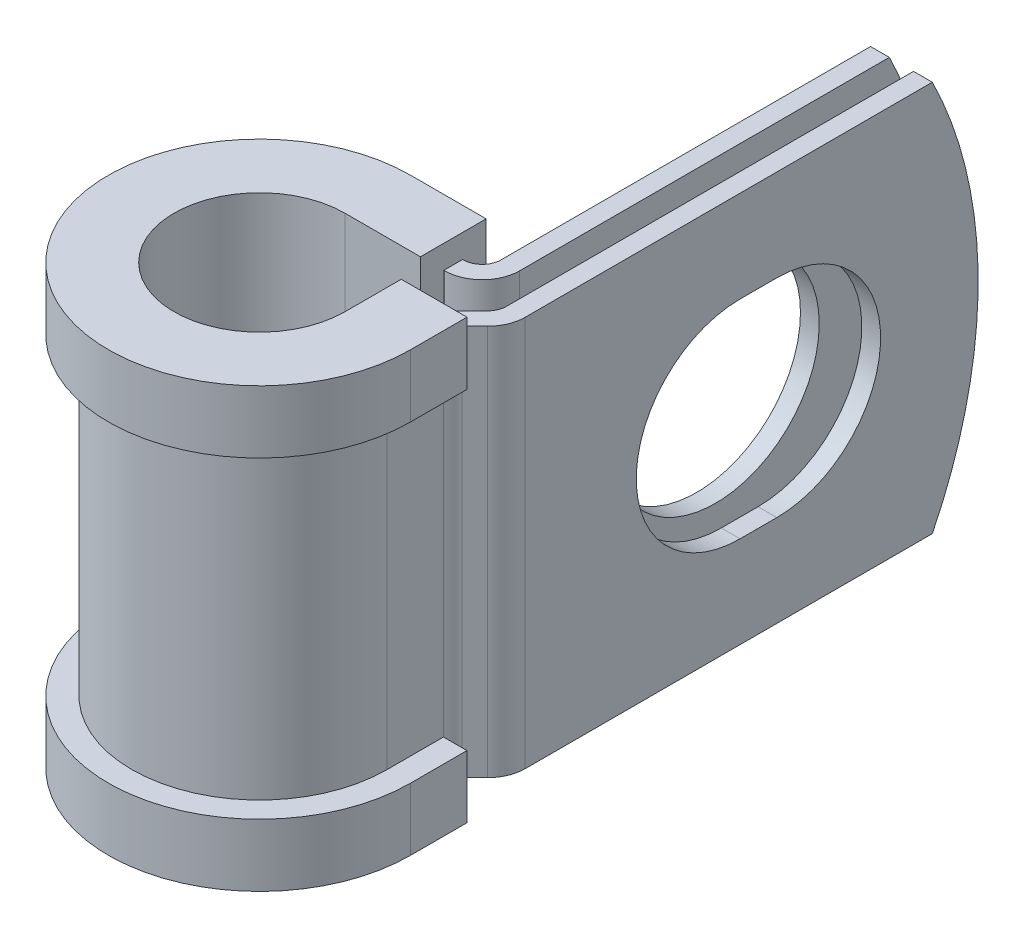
ISO-10303-21;
HEADER;
FILE_DESCRIPTION(('STEP AP214'),'2;1');
FILE_NAME('part.step','',(''),(''),'','','');
FILE_SCHEMA(('AUTOMOTIVE_DESIGN { 1 0 10303 214 1 1 1 1 }'));
ENDSEC;
DATA;
#1=APPLICATION_CONTEXT('core data for automotive mechanical design processes');
#2=APPLICATION_PROTOCOL_DEFINITION('international standard','automotive_design',2000,#1);
#3=PRODUCT_CONTEXT('',#1,'mechanical');
#4=PRODUCT('Part','Part','',(#3));
#5=PRODUCT_RELATED_PRODUCT_CATEGORY('part','',(#4));
#6=PRODUCT_DEFINITION_FORMATION('','',#4);
#7=PRODUCT_DEFINITION_CONTEXT('part definition',#1,'design');
#8=PRODUCT_DEFINITION('design','',#6,#7);
#9=PRODUCT_DEFINITION_SHAPE('','',#8);
#10=(LENGTH_UNIT() NAMED_UNIT(*) SI_UNIT(.MILLI.,.METRE.));
#11=(NAMED_UNIT(*) PLANE_ANGLE_UNIT() SI_UNIT($,.RADIAN.));
#12=(NAMED_UNIT(*) SI_UNIT($,.STERADIAN.) SOLID_ANGLE_UNIT());
#13=UNCERTAINTY_MEASURE_WITH_UNIT(LENGTH_MEASURE(1.E-05),#10,'distance_accuracy_value','');
#14=(GEOMETRIC_REPRESENTATION_CONTEXT(3) GLOBAL_UNCERTAINTY_ASSIGNED_CONTEXT((#13)) GLOBAL_UNIT_ASSIGNED_CONTEXT((#10,
#11,#12)) REPRESENTATION_CONTEXT('',''));
#15=CARTESIAN_POINT('',(0.,0.,0.));
#16=DIRECTION('',(0.,0.,1.));
#17=DIRECTION('',(1.,0.,0.));
#18=AXIS2_PLACEMENT_3D('',#15,#16,#17);
#19=CARTESIAN_POINT('',(7.75216980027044,-12.7,-7.0739));
#20=DIRECTION('',(0.,1.,0.));
#21=DIRECTION('',(1.,0.,0.));
#22=AXIS2_PLACEMENT_3D('',#19,#20,#21);
#23=PLANE('',#22);
#24=DIRECTION('',(0.,0.,-1.));
#25=VECTOR('',#24,1.);
#26=CARTESIAN_POINT('',(4.90736980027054,-12.7,-7.0739));
#27=LINE('',#26,#25);
#28=CARTESIAN_POINT('',(4.90736980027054,-12.7,-7.0739));
#29=VERTEX_POINT('',#28);
#30=CARTESIAN_POINT('',(4.90736980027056,-12.7,-8.2931));
#31=VERTEX_POINT('',#30);
#32=EDGE_CURVE('E523',#29,#31,#27,.T.);
#33=ORIENTED_EDGE('',*,*,#32,.T.);
#34=DIRECTION('',(1.,0.,0.));
#35=VECTOR('',#34,1.);
#36=CARTESIAN_POINT('',(0.,-12.7,-8.2931));
#37=LINE('',#36,#35);
#38=CARTESIAN_POINT('',(4.95816980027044,-12.7,-8.2931));
#39=VERTEX_POINT('',#38);
#40=EDGE_CURVE('E410',#39,#31,#37,.F.);
#41=ORIENTED_EDGE('',*,*,#40,.F.);
#42=CARTESIAN_POINT('',(4.95816980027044,-12.7,-9.5123));
#43=DIRECTION('',(0.,1.,0.));
#44=DIRECTION('',(1.,0.,0.));
#45=AXIS2_PLACEMENT_3D('',#42,#43,#44);
#46=CIRCLE('',#45,1.2192);
#47=CARTESIAN_POINT('',(6.17736980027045,-12.7,-9.5123));
#48=VERTEX_POINT('',#47);
#49=EDGE_CURVE('E408',#48,#39,#46,.F.);
#50=ORIENTED_EDGE('',*,*,#49,.F.);
#51=DIRECTION('',(0.,0.,1.));
#52=VECTOR('',#51,1.);
#53=CARTESIAN_POINT('',(6.17736980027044,-12.7,-36.4998));
#54=LINE('',#53,#52);
#55=CARTESIAN_POINT('',(6.17736980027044,-12.7,-33.5224683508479));
#56=VERTEX_POINT('',#55);
#57=EDGE_CURVE('E406',#56,#48,#54,.T.);
#58=ORIENTED_EDGE('',*,*,#57,.F.);
#59=DIRECTION('',(-1.,0.,0.));
#60=VECTOR('',#59,1.);
#61=CARTESIAN_POINT('',(10.1905698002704,-12.7,-33.5224683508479));
#62=LINE('',#61,#60);
#63=CARTESIAN_POINT('',(7.39656980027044,-12.7,-33.5224683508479));
#64=VERTEX_POINT('',#63);
#65=EDGE_CURVE('E12',#64,#56,#62,.T.);
#66=ORIENTED_EDGE('',*,*,#65,.F.);
#67=DIRECTION('',(0.,0.,1.));
#68=VECTOR('',#67,1.);
#69=CARTESIAN_POINT('',(7.39656980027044,-12.7,-36.4998));
#70=LINE('',#69,#68);
#71=CARTESIAN_POINT('',(7.39656980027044,-12.7,-9.5123));
#72=VERTEX_POINT('',#71);
#73=EDGE_CURVE('E404',#64,#72,#70,.T.);
#74=ORIENTED_EDGE('',*,*,#73,.T.);
#75=CARTESIAN_POINT('',(4.95816980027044,-12.7,-9.5123));
#76=DIRECTION('',(0.,-1.,0.));
#77=DIRECTION('',(0.,0.,1.));
#78=AXIS2_PLACEMENT_3D('',#75,#76,#77);
#79=CIRCLE('',#78,2.4384);
#80=CARTESIAN_POINT('',(4.95816980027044,-12.7,-7.0739));
#81=VERTEX_POINT('',#80);
#82=EDGE_CURVE('E401',#72,#81,#79,.T.);
#83=ORIENTED_EDGE('',*,*,#82,.T.);
#84=DIRECTION('',(-1.,0.,0.));
#85=VECTOR('',#84,1.);
#86=CARTESIAN_POINT('',(0.,-12.7,-7.0739));
#87=LINE('',#86,#85);
#88=EDGE_CURVE('E398',#81,#29,#87,.T.);
#89=ORIENTED_EDGE('',*,*,#88,.T.);
#90=EDGE_LOOP('',(#33,#41,#50,#58,#66,#74,#83,#89));
#91=FACE_BOUND('',#90,.T.);
#92=ADVANCED_FACE('F54',(#91),#23,.F.);
#93=CARTESIAN_POINT('',(7.75216980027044,12.7,-7.0739));
#94=DIRECTION('',(0.,1.,0.));
#95=DIRECTION('',(1.,0.,0.));
#96=AXIS2_PLACEMENT_3D('',#93,#94,#95);
#97=PLANE('',#96);
#98=DIRECTION('',(1.,0.,0.));
#99=VECTOR('',#98,1.);
#100=CARTESIAN_POINT('',(0.,12.7,-8.2931));
#101=LINE('',#100,#99);
#102=CARTESIAN_POINT('',(4.95816980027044,12.7,-8.2931));
#103=VERTEX_POINT('',#102);
#104=CARTESIAN_POINT('',(4.90736980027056,12.7,-8.2931));
#105=VERTEX_POINT('',#104);
#106=EDGE_CURVE('E368',#103,#105,#101,.F.);
#107=ORIENTED_EDGE('',*,*,#106,.T.);
#108=DIRECTION('',(0.,0.,1.));
#109=VECTOR('',#108,1.);
#110=CARTESIAN_POINT('',(4.90736980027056,12.7,-8.2931));
#111=LINE('',#110,#109);
#112=CARTESIAN_POINT('',(4.90736980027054,12.7,-7.0739));
#113=VERTEX_POINT('',#112);
#114=EDGE_CURVE('E517',#105,#113,#111,.T.);
#115=ORIENTED_EDGE('',*,*,#114,.T.);
#116=DIRECTION('',(-1.,0.,0.));
#117=VECTOR('',#116,1.);
#118=CARTESIAN_POINT('',(0.,12.7,-7.0739));
#119=LINE('',#118,#117);
#120=CARTESIAN_POINT('',(4.95816980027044,12.7,-7.0739));
#121=VERTEX_POINT('',#120);
#122=EDGE_CURVE('E625',#121,#113,#119,.T.);
#123=ORIENTED_EDGE('',*,*,#122,.F.);
#124=CARTESIAN_POINT('',(4.95816980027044,12.7,-9.5123));
#125=DIRECTION('',(0.,-1.,0.));
#126=DIRECTION('',(0.,0.,1.));
#127=AXIS2_PLACEMENT_3D('',#124,#125,#126);
#128=CIRCLE('',#127,2.4384);
#129=CARTESIAN_POINT('',(7.39656980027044,12.7,-9.5123));
#130=VERTEX_POINT('',#129);
#131=EDGE_CURVE('E370',#130,#121,#128,.T.);
#132=ORIENTED_EDGE('',*,*,#131,.F.);
#133=DIRECTION('',(0.,0.,1.));
#134=VECTOR('',#133,1.);
#135=CARTESIAN_POINT('',(7.39656980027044,12.7,-36.4998));
#136=LINE('',#135,#134);
#137=CARTESIAN_POINT('',(7.39656980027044,12.7,-33.5224683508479));
#138=VERTEX_POINT('',#137);
#139=EDGE_CURVE('E361',#138,#130,#136,.T.);
#140=ORIENTED_EDGE('',*,*,#139,.F.);
#141=DIRECTION('',(-1.,0.,0.));
#142=VECTOR('',#141,1.);
#143=CARTESIAN_POINT('',(10.1905698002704,12.7,-33.5224683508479));
#144=LINE('',#143,#142);
#145=CARTESIAN_POINT('',(6.17736980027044,12.7,-33.5224683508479));
#146=VERTEX_POINT('',#145);
#147=EDGE_CURVE('E62',#138,#146,#144,.T.);
#148=ORIENTED_EDGE('',*,*,#147,.T.);
#149=DIRECTION('',(0.,0.,1.));
#150=VECTOR('',#149,1.);
#151=CARTESIAN_POINT('',(6.17736980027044,12.7,-36.4998));
#152=LINE('',#151,#150);
#153=CARTESIAN_POINT('',(6.17736980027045,12.7,-9.5123));
#154=VERTEX_POINT('',#153);
#155=EDGE_CURVE('E358',#146,#154,#152,.T.);
#156=ORIENTED_EDGE('',*,*,#155,.T.);
#157=CARTESIAN_POINT('',(4.95816980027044,12.7,-9.5123));
#158=DIRECTION('',(0.,1.,0.));
#159=DIRECTION('',(1.,0.,0.));
#160=AXIS2_PLACEMENT_3D('',#157,#158,#159);
#161=CIRCLE('',#160,1.2192);
#162=EDGE_CURVE('E366',#154,#103,#161,.F.);
#163=ORIENTED_EDGE('',*,*,#162,.T.);
#164=EDGE_LOOP('',(#107,#115,#123,#132,#140,#148,#156,#163));
#165=FACE_BOUND('',#164,.T.);
#166=ADVANCED_FACE('F357',(#165),#97,.T.);
#167=CARTESIAN_POINT('',(0.,12.7,-7.0739));
#168=DIRECTION('',(0.,0.,1.));
#169=DIRECTION('',(1.,0.,0.));
#170=AXIS2_PLACEMENT_3D('',#167,#168,#169);
#171=PLANE('',#170);
#172=ORIENTED_EDGE('',*,*,#122,.T.);
#173=DIRECTION('',(0.,-1.,0.));
#174=VECTOR('',#173,1.);
#175=CARTESIAN_POINT('',(4.90736980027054,12.7,-7.0739));
#176=LINE('',#175,#174);
#177=EDGE_CURVE('E520',#113,#29,#176,.T.);
#178=ORIENTED_EDGE('',*,*,#177,.T.);
#179=ORIENTED_EDGE('',*,*,#88,.F.);
#180=DIRECTION('',(0.,-1.,0.));
#181=VECTOR('',#180,1.);
#182=CARTESIAN_POINT('',(4.95816980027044,12.7,-7.0739));
#183=LINE('',#182,#181);
#184=EDGE_CURVE('E344',#121,#81,#183,.T.);
#185=ORIENTED_EDGE('',*,*,#184,.F.);
#186=EDGE_LOOP('',(#172,#178,#179,#185));
#187=FACE_BOUND('',#186,.T.);
#188=ADVANCED_FACE('F635',(#187),#171,.T.);
#189=CARTESIAN_POINT('',(10.1905698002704,12.7,-7.0739));
#190=DIRECTION('',(-1.,0.,0.));
#191=DIRECTION('',(0.,0.,1.));
#192=AXIS2_PLACEMENT_3D('',#189,#190,#191);
#193=PLANE('',#192);
#194=CARTESIAN_POINT('',(10.1905698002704,0.,-23.4187999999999));
#195=DIRECTION('',(1.,0.,0.));
#196=DIRECTION('',(0.,0.,-1.));
#197=AXIS2_PLACEMENT_3D('',#194,#195,#196);
#198=CIRCLE('',#197,6.7437);
#199=CARTESIAN_POINT('',(10.1905698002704,-6.7437,-23.4188000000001));
#200=VERTEX_POINT('',#199);
#201=CARTESIAN_POINT('',(10.1905698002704,6.7437,-23.4188000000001));
#202=VERTEX_POINT('',#201);
#203=EDGE_CURVE('E580',#200,#202,#198,.T.);
#204=ORIENTED_EDGE('',*,*,#203,.F.);
#205=DIRECTION('',(0.,0.,-1.));
#206=VECTOR('',#205,1.);
#207=CARTESIAN_POINT('',(10.1905698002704,-6.7437,-21.0311999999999));
#208=LINE('',#207,#206);
#209=CARTESIAN_POINT('',(10.1905698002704,-6.7437,-21.0311999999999));
#210=VERTEX_POINT('',#209);
#211=EDGE_CURVE('E583',#210,#200,#208,.T.);
#212=ORIENTED_EDGE('',*,*,#211,.F.);
#213=CARTESIAN_POINT('',(10.1905698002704,0.,-21.0311999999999));
#214=DIRECTION('',(1.,0.,0.));
#215=DIRECTION('',(0.,0.,-1.));
#216=AXIS2_PLACEMENT_3D('',#213,#214,#215);
#217=CIRCLE('',#216,6.7437);
#218=CARTESIAN_POINT('',(10.1905698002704,6.7437,-21.0311999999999));
#219=VERTEX_POINT('',#218);
#220=EDGE_CURVE('E576',#219,#210,#217,.T.);
#221=ORIENTED_EDGE('',*,*,#220,.F.);
#222=DIRECTION('',(0.,0.,1.));
#223=VECTOR('',#222,1.);
#224=CARTESIAN_POINT('',(10.1905698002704,6.7437,-21.0311999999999));
#225=LINE('',#224,#223);
#226=EDGE_CURVE('E577',#202,#219,#225,.T.);
#227=ORIENTED_EDGE('',*,*,#226,.F.);
#228=EDGE_LOOP('',(#204,#212,#221,#227));
#229=FACE_BOUND('',#228,.T.);
#230=DIRECTION('',(0.,0.,-1.));
#231=VECTOR('',#230,1.);
#232=CARTESIAN_POINT('',(10.1905698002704,-12.7,-7.0739));
#233=LINE('',#232,#231);
#234=CARTESIAN_POINT('',(10.1905698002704,-12.7,-7.0739));
#235=VERTEX_POINT('',#234);
#236=CARTESIAN_POINT('',(10.1905698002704,-12.7,-33.5224683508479));
#237=VERTEX_POINT('',#236);
#238=EDGE_CURVE('E382',#235,#237,#233,.T.);
#239=ORIENTED_EDGE('',*,*,#238,.T.);
#240=CARTESIAN_POINT('',(10.1905698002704,0.,-7.9248));
#241=DIRECTION('',(-1.,0.,0.));
#242=DIRECTION('',(0.,0.,1.));
#243=AXIS2_PLACEMENT_3D('',#240,#241,#242);
#244=CIRCLE('',#243,28.575);
#245=CARTESIAN_POINT('',(10.1905698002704,12.7,-33.5224683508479));
#246=VERTEX_POINT('',#245);
#247=EDGE_CURVE('E568',#246,#237,#244,.T.);
#248=ORIENTED_EDGE('',*,*,#247,.F.);
#249=DIRECTION('',(0.,0.,-1.));
#250=VECTOR('',#249,1.);
#251=CARTESIAN_POINT('',(10.1905698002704,12.7,-7.0739));
#252=LINE('',#251,#250);
#253=CARTESIAN_POINT('',(10.1905698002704,12.7,-7.0739));
#254=VERTEX_POINT('',#253);
#255=EDGE_CURVE('E419',#254,#246,#252,.T.);
#256=ORIENTED_EDGE('',*,*,#255,.F.);
#257=DIRECTION('',(0.,-1.,0.));
#258=VECTOR('',#257,1.);
#259=CARTESIAN_POINT('',(10.1905698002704,12.7,-7.0739));
#260=LINE('',#259,#258);
#261=EDGE_CURVE('E381',#254,#235,#260,.T.);
#262=ORIENTED_EDGE('',*,*,#261,.T.);
#263=EDGE_LOOP('',(#239,#248,#256,#262));
#264=FACE_BOUND('',#263,.T.);
#265=ADVANCED_FACE('F56',(#229,#264),#193,.F.);
#266=CARTESIAN_POINT('',(8.97136980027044,12.7,-7.0739));
#267=DIRECTION('',(-1.,0.,0.));
#268=DIRECTION('',(0.,0.,1.));
#269=AXIS2_PLACEMENT_3D('',#266,#267,#268);
#270=PLANE('',#269);
#271=DIRECTION('',(0.,0.,-1.));
#272=VECTOR('',#271,1.);
#273=CARTESIAN_POINT('',(8.97136980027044,-6.7437,-21.0311999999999));
#274=LINE('',#273,#272);
#275=CARTESIAN_POINT('',(8.97136980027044,-6.7437,-21.0311999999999));
#276=VERTEX_POINT('',#275);
#277=CARTESIAN_POINT('',(8.97136980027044,-6.7437,-23.4188000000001));
#278=VERTEX_POINT('',#277);
#279=EDGE_CURVE('E579',#276,#278,#274,.T.);
#280=ORIENTED_EDGE('',*,*,#279,.T.);
#281=CARTESIAN_POINT('',(8.97136980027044,0.,-23.4187999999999));
#282=DIRECTION('',(-1.,0.,0.));
#283=DIRECTION('',(0.,0.,1.));
#284=AXIS2_PLACEMENT_3D('',#281,#282,#283);
#285=CIRCLE('',#284,6.7437);
#286=CARTESIAN_POINT('',(8.97136980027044,6.7437,-23.4188000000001));
#287=VERTEX_POINT('',#286);
#288=EDGE_CURVE('E600',#278,#287,#285,.F.);
#289=ORIENTED_EDGE('',*,*,#288,.T.);
#290=DIRECTION('',(0.,0.,1.));
#291=VECTOR('',#290,1.);
#292=CARTESIAN_POINT('',(8.97136980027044,6.7437,-21.0311999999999));
#293=LINE('',#292,#291);
#294=CARTESIAN_POINT('',(8.97136980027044,6.7437,-21.0311999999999));
#295=VERTEX_POINT('',#294);
#296=EDGE_CURVE('E596',#287,#295,#293,.T.);
#297=ORIENTED_EDGE('',*,*,#296,.T.);
#298=CARTESIAN_POINT('',(8.97136980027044,0.,-21.0311999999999));
#299=DIRECTION('',(-1.,0.,0.));
#300=DIRECTION('',(0.,0.,1.));
#301=AXIS2_PLACEMENT_3D('',#298,#299,#300);
#302=CIRCLE('',#301,6.7437);
#303=EDGE_CURVE('E591',#295,#276,#302,.F.);
#304=ORIENTED_EDGE('',*,*,#303,.T.);
#305=EDGE_LOOP('',(#280,#289,#297,#304));
#306=FACE_BOUND('',#305,.T.);
#307=CARTESIAN_POINT('',(8.97136980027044,0.,-7.9248));
#308=DIRECTION('',(-1.,0.,0.));
#309=DIRECTION('',(0.,0.,1.));
#310=AXIS2_PLACEMENT_3D('',#307,#308,#309);
#311=CIRCLE('',#310,28.575);
#312=CARTESIAN_POINT('',(8.97136980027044,12.7,-33.5224683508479));
#313=VERTEX_POINT('',#312);
#314=CARTESIAN_POINT('',(8.97136980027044,-12.7,-33.5224683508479));
#315=VERTEX_POINT('',#314);
#316=EDGE_CURVE('E76',#313,#315,#311,.T.);
#317=ORIENTED_EDGE('',*,*,#316,.T.);
#318=DIRECTION('',(0.,0.,-1.));
#319=VECTOR('',#318,1.);
#320=CARTESIAN_POINT('',(8.97136980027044,-12.7,-7.0739));
#321=LINE('',#320,#319);
#322=CARTESIAN_POINT('',(8.97136980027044,-12.7,-7.0739));
#323=VERTEX_POINT('',#322);
#324=EDGE_CURVE('E385',#323,#315,#321,.T.);
#325=ORIENTED_EDGE('',*,*,#324,.F.);
#326=DIRECTION('',(0.,-1.,0.));
#327=VECTOR('',#326,1.);
#328=CARTESIAN_POINT('',(8.97136980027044,12.7,-7.0739));
#329=LINE('',#328,#327);
#330=CARTESIAN_POINT('',(8.97136980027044,12.7,-7.0739));
#331=VERTEX_POINT('',#330);
#332=EDGE_CURVE('E352',#331,#323,#329,.T.);
#333=ORIENTED_EDGE('',*,*,#332,.F.);
#334=DIRECTION('',(0.,0.,-1.));
#335=VECTOR('',#334,1.);
#336=CARTESIAN_POINT('',(8.97136980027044,12.7,-7.0739));
#337=LINE('',#336,#335);
#338=EDGE_CURVE('E615',#331,#313,#337,.T.);
#339=ORIENTED_EDGE('',*,*,#338,.T.);
#340=EDGE_LOOP('',(#317,#325,#333,#339));
#341=FACE_BOUND('',#340,.T.);
#342=ADVANCED_FACE('F689',(#306,#341),#270,.T.);
#343=CARTESIAN_POINT('',(7.39656980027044,12.7,-36.4998));
#344=DIRECTION('',(1.,0.,0.));
#345=DIRECTION('',(0.,0.,-1.));
#346=AXIS2_PLACEMENT_3D('',#343,#344,#345);
#347=PLANE('',#346);
#348=CARTESIAN_POINT('',(7.39656980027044,0.,-22.225));
#349=DIRECTION('',(1.,0.,0.));
#350=DIRECTION('',(0.,0.,-1.));
#351=AXIS2_PLACEMENT_3D('',#348,#349,#350);
#352=CIRCLE('',#351,6.7437);
#353=CARTESIAN_POINT('',(7.39656980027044,0.,-28.9687));
#354=VERTEX_POINT('',#353);
#355=EDGE_CURVE('E386',#354,#354,#352,.F.);
#356=ORIENTED_EDGE('',*,*,#355,.T.);
#357=EDGE_LOOP('',(#356));
#358=FACE_BOUND('',#357,.T.);
#359=ORIENTED_EDGE('',*,*,#73,.F.);
#360=CARTESIAN_POINT('',(7.39656980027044,0.,-7.9248));
#361=DIRECTION('',(1.,0.,0.));
#362=DIRECTION('',(0.,0.,-1.));
#363=AXIS2_PLACEMENT_3D('',#360,#361,#362);
#364=CIRCLE('',#363,28.575);
#365=EDGE_CURVE('E573',#64,#138,#364,.T.);
#366=ORIENTED_EDGE('',*,*,#365,.T.);
#367=ORIENTED_EDGE('',*,*,#139,.T.);
#368=DIRECTION('',(0.,-1.,0.));
#369=VECTOR('',#368,1.);
#370=CARTESIAN_POINT('',(7.39656980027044,12.7,-9.5123));
#371=LINE('',#370,#369);
#372=EDGE_CURVE('E341',#130,#72,#371,.T.);
#373=ORIENTED_EDGE('',*,*,#372,.T.);
#374=EDGE_LOOP('',(#359,#366,#367,#373));
#375=FACE_BOUND('',#374,.T.);
#376=ADVANCED_FACE('F641',(#358,#375),#347,.T.);
#377=CARTESIAN_POINT('',(6.17736980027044,12.7,-36.4998));
#378=DIRECTION('',(1.,0.,0.));
#379=DIRECTION('',(0.,0.,-1.));
#380=AXIS2_PLACEMENT_3D('',#377,#378,#379);
#381=PLANE('',#380);
#382=CARTESIAN_POINT('',(6.17736980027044,0.,-22.225));
#383=DIRECTION('',(-1.,0.,0.));
#384=DIRECTION('',(0.,0.,1.));
#385=AXIS2_PLACEMENT_3D('',#382,#383,#384);
#386=CIRCLE('',#385,6.7437);
#387=CARTESIAN_POINT('',(6.17736980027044,0.,-15.4813));
#388=VERTEX_POINT('',#387);
#389=EDGE_CURVE('E608',#388,#388,#386,.T.);
#390=ORIENTED_EDGE('',*,*,#389,.F.);
#391=EDGE_LOOP('',(#390));
#392=FACE_BOUND('',#391,.T.);
#393=CARTESIAN_POINT('',(6.17736980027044,0.,-7.9248));
#394=DIRECTION('',(-1.,0.,0.));
#395=DIRECTION('',(0.,0.,1.));
#396=AXIS2_PLACEMENT_3D('',#393,#394,#395);
#397=CIRCLE('',#396,28.575);
#398=EDGE_CURVE('E68',#146,#56,#397,.T.);
#399=ORIENTED_EDGE('',*,*,#398,.T.);
#400=ORIENTED_EDGE('',*,*,#57,.T.);
#401=DIRECTION('',(0.,-1.,0.));
#402=VECTOR('',#401,1.);
#403=CARTESIAN_POINT('',(6.17736980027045,12.7,-9.5123));
#404=LINE('',#403,#402);
#405=EDGE_CURVE('E338',#154,#48,#404,.T.);
#406=ORIENTED_EDGE('',*,*,#405,.F.);
#407=ORIENTED_EDGE('',*,*,#155,.F.);
#408=EDGE_LOOP('',(#399,#400,#406,#407));
#409=FACE_BOUND('',#408,.T.);
#410=ADVANCED_FACE('F364',(#392,#409),#381,.F.);
#411=CARTESIAN_POINT('',(9.5123,-12.7,-3.66140267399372));
#412=DIRECTION('',(0.,1.,0.));
#413=DIRECTION('',(1.,0.,0.));
#414=AXIS2_PLACEMENT_3D('',#411,#412,#413);
#415=CIRCLE('',#414,1.2192);
#416=CARTESIAN_POINT('',(8.2931,-12.7,-3.66140267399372));
#417=VERTEX_POINT('',#416);
#418=CARTESIAN_POINT('',(8.65019541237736,-12.7,-4.52350726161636));
#419=VERTEX_POINT('',#418);
#420=EDGE_CURVE('E413',#417,#419,#415,.F.);
#421=ORIENTED_EDGE('',*,*,#420,.F.);
#422=DIRECTION('',(1.,0.,0.));
#423=VECTOR('',#422,1.);
#424=CARTESIAN_POINT('',(7.0739,-12.7,-3.66140267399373));
#425=LINE('',#424,#423);
#426=CARTESIAN_POINT('',(7.0739,-12.7,-3.66140267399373));
#427=VERTEX_POINT('',#426);
#428=EDGE_CURVE('E451',#427,#417,#425,.T.);
#429=ORIENTED_EDGE('',*,*,#428,.F.);
#430=CARTESIAN_POINT('',(9.5123,-12.7,-3.66140267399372));
#431=DIRECTION('',(0.,-1.,0.));
#432=DIRECTION('',(0.,0.,1.));
#433=AXIS2_PLACEMENT_3D('',#430,#431,#432);
#434=CIRCLE('',#433,2.4384);
#435=CARTESIAN_POINT('',(7.78809082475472,-12.7,-5.385611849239));
#436=VERTEX_POINT('',#435);
#437=EDGE_CURVE('E395',#427,#436,#434,.T.);
#438=ORIENTED_EDGE('',*,*,#437,.T.);
#439=DIRECTION('',(0.707106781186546,0.,-0.707106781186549));
#440=VECTOR('',#439,1.);
#441=CARTESIAN_POINT('',(7.78809082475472,-12.7,-5.385611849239));
#442=LINE('',#441,#440);
#443=CARTESIAN_POINT('',(8.61427438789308,-12.7,-6.21179541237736));
#444=VERTEX_POINT('',#443);
#445=EDGE_CURVE('E392',#436,#444,#442,.T.);
#446=ORIENTED_EDGE('',*,*,#445,.T.);
#447=CARTESIAN_POINT('',(7.75216980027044,-12.7,-7.0739));
#448=DIRECTION('',(0.,1.,0.));
#449=DIRECTION('',(0.,0.,1.));
#450=AXIS2_PLACEMENT_3D('',#447,#448,#449);
#451=CIRCLE('',#450,1.2192);
#452=EDGE_CURVE('E389',#444,#323,#451,.T.);
#453=ORIENTED_EDGE('',*,*,#452,.T.);
#454=ORIENTED_EDGE('',*,*,#324,.T.);
#455=DIRECTION('',(-1.,0.,0.));
#456=VECTOR('',#455,1.);
#457=CARTESIAN_POINT('',(10.1905698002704,-12.7,-33.5224683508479));
#458=LINE('',#457,#456);
#459=EDGE_CURVE('E566',#237,#315,#458,.T.);
#460=ORIENTED_EDGE('',*,*,#459,.F.);
#461=ORIENTED_EDGE('',*,*,#238,.F.);
#462=CARTESIAN_POINT('',(7.75216980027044,-12.7,-7.0739));
#463=DIRECTION('',(0.,1.,0.));
#464=DIRECTION('',(1.,0.,0.));
#465=AXIS2_PLACEMENT_3D('',#462,#463,#464);
#466=CIRCLE('',#465,2.4384);
#467=CARTESIAN_POINT('',(9.47637897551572,-12.7,-5.34969082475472));
#468=VERTEX_POINT('',#467);
#469=EDGE_CURVE('E417',#468,#235,#466,.T.);
#470=ORIENTED_EDGE('',*,*,#469,.F.);
#471=DIRECTION('',(0.707106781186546,0.,-0.707106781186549));
#472=VECTOR('',#471,1.);
#473=CARTESIAN_POINT('',(8.65019541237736,-12.7,-4.52350726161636));
#474=LINE('',#473,#472);
#475=EDGE_CURVE('E415',#419,#468,#474,.T.);
#476=ORIENTED_EDGE('',*,*,#475,.F.);
#477=EDGE_LOOP('',(#421,#429,#438,#446,#453,#454,#460,#461,#470,#476));
#478=FACE_BOUND('',#477,.T.);
#479=ADVANCED_FACE('F675',(#478),#23,.F.);
#480=DIRECTION('',(-1.,0.,0.));
#481=VECTOR('',#480,1.);
#482=CARTESIAN_POINT('',(8.2931,12.7,-3.66140267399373));
#483=LINE('',#482,#481);
#484=CARTESIAN_POINT('',(8.2931,12.7,-3.66140267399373));
#485=VERTEX_POINT('',#484);
#486=CARTESIAN_POINT('',(7.0739,12.7,-3.66140267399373));
#487=VERTEX_POINT('',#486);
#488=EDGE_CURVE('E440',#485,#487,#483,.T.);
#489=ORIENTED_EDGE('',*,*,#488,.F.);
#490=CARTESIAN_POINT('',(9.5123,12.7,-3.66140267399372));
#491=DIRECTION('',(0.,1.,0.));
#492=DIRECTION('',(1.,0.,0.));
#493=AXIS2_PLACEMENT_3D('',#490,#491,#492);
#494=CIRCLE('',#493,1.2192);
#495=CARTESIAN_POINT('',(8.65019541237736,12.7,-4.52350726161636));
#496=VERTEX_POINT('',#495);
#497=EDGE_CURVE('E375',#485,#496,#494,.F.);
#498=ORIENTED_EDGE('',*,*,#497,.T.);
#499=DIRECTION('',(0.707106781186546,0.,-0.707106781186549));
#500=VECTOR('',#499,1.);
#501=CARTESIAN_POINT('',(8.65019541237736,12.7,-4.52350726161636));
#502=LINE('',#501,#500);
#503=CARTESIAN_POINT('',(9.47637897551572,12.7,-5.34969082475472));
#504=VERTEX_POINT('',#503);
#505=EDGE_CURVE('E377',#496,#504,#502,.T.);
#506=ORIENTED_EDGE('',*,*,#505,.T.);
#507=CARTESIAN_POINT('',(7.75216980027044,12.7,-7.0739));
#508=DIRECTION('',(0.,1.,0.));
#509=DIRECTION('',(1.,0.,0.));
#510=AXIS2_PLACEMENT_3D('',#507,#508,#509);
#511=CIRCLE('',#510,2.4384);
#512=EDGE_CURVE('E379',#504,#254,#511,.T.);
#513=ORIENTED_EDGE('',*,*,#512,.T.);
#514=ORIENTED_EDGE('',*,*,#255,.T.);
#515=DIRECTION('',(-1.,0.,0.));
#516=VECTOR('',#515,1.);
#517=CARTESIAN_POINT('',(10.1905698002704,12.7,-33.5224683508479));
#518=LINE('',#517,#516);
#519=EDGE_CURVE('E570',#246,#313,#518,.T.);
#520=ORIENTED_EDGE('',*,*,#519,.T.);
#521=ORIENTED_EDGE('',*,*,#338,.F.);
#522=CARTESIAN_POINT('',(7.75216980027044,12.7,-7.0739));
#523=DIRECTION('',(0.,1.,0.));
#524=DIRECTION('',(0.,0.,1.));
#525=AXIS2_PLACEMENT_3D('',#522,#523,#524);
#526=CIRCLE('',#525,1.2192);
#527=CARTESIAN_POINT('',(8.61427438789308,12.7,-6.21179541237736));
#528=VERTEX_POINT('',#527);
#529=EDGE_CURVE('E618',#528,#331,#526,.T.);
#530=ORIENTED_EDGE('',*,*,#529,.F.);
#531=DIRECTION('',(0.707106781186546,0.,-0.707106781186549));
#532=VECTOR('',#531,1.);
#533=CARTESIAN_POINT('',(7.78809082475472,12.7,-5.385611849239));
#534=LINE('',#533,#532);
#535=CARTESIAN_POINT('',(7.78809082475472,12.7,-5.385611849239));
#536=VERTEX_POINT('',#535);
#537=EDGE_CURVE('E621',#536,#528,#534,.T.);
#538=ORIENTED_EDGE('',*,*,#537,.F.);
#539=CARTESIAN_POINT('',(9.5123,12.7,-3.66140267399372));
#540=DIRECTION('',(0.,-1.,0.));
#541=DIRECTION('',(0.,0.,1.));
#542=AXIS2_PLACEMENT_3D('',#539,#540,#541);
#543=CIRCLE('',#542,2.4384);
#544=EDGE_CURVE('E450',#487,#536,#543,.T.);
#545=ORIENTED_EDGE('',*,*,#544,.F.);
#546=EDGE_LOOP('',(#489,#498,#506,#513,#514,#520,#521,#530,#538,#545));
#547=FACE_BOUND('',#546,.T.);
#548=ADVANCED_FACE('F447',(#547),#97,.T.);
#549=CARTESIAN_POINT('',(7.75216980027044,12.7,-7.0739));
#550=DIRECTION('',(0.,-1.,0.));
#551=DIRECTION('',(0.,0.,-1.));
#552=AXIS2_PLACEMENT_3D('',#549,#550,#551);
#553=CYLINDRICAL_SURFACE('',#552,1.2192);
#554=ORIENTED_EDGE('',*,*,#452,.F.);
#555=DIRECTION('',(0.,-1.,0.));
#556=VECTOR('',#555,1.);
#557=CARTESIAN_POINT('',(8.61427438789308,12.7,-6.21179541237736));
#558=LINE('',#557,#556);
#559=EDGE_CURVE('E350',#528,#444,#558,.T.);
#560=ORIENTED_EDGE('',*,*,#559,.F.);
#561=ORIENTED_EDGE('',*,*,#529,.T.);
#562=ORIENTED_EDGE('',*,*,#332,.T.);
#563=EDGE_LOOP('',(#554,#560,#561,#562));
#564=FACE_BOUND('',#563,.T.);
#565=ADVANCED_FACE('F685',(#564),#553,.F.);
#566=CARTESIAN_POINT('',(7.78809082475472,12.7,-5.385611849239));
#567=DIRECTION('',(-0.707106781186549,0.,-0.707106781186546));
#568=DIRECTION('',(-0.707106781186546,0.,0.707106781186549));
#569=AXIS2_PLACEMENT_3D('',#566,#567,#568);
#570=PLANE('',#569);
#571=ORIENTED_EDGE('',*,*,#445,.F.);
#572=DIRECTION('',(0.,-1.,0.));
#573=VECTOR('',#572,1.);
#574=CARTESIAN_POINT('',(7.78809082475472,12.7,-5.385611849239));
#575=LINE('',#574,#573);
#576=EDGE_CURVE('E348',#536,#436,#575,.T.);
#577=ORIENTED_EDGE('',*,*,#576,.F.);
#578=ORIENTED_EDGE('',*,*,#537,.T.);
#579=ORIENTED_EDGE('',*,*,#559,.T.);
#580=EDGE_LOOP('',(#571,#577,#578,#579));
#581=FACE_BOUND('',#580,.T.);
#582=ADVANCED_FACE('F680',(#581),#570,.T.);
#583=CARTESIAN_POINT('',(9.5123,12.7,-3.66140267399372));
#584=DIRECTION('',(0.,-1.,0.));
#585=DIRECTION('',(0.,0.,-1.));
#586=AXIS2_PLACEMENT_3D('',#583,#584,#585);
#587=CYLINDRICAL_SURFACE('',#586,2.4384);
#588=ORIENTED_EDGE('',*,*,#437,.F.);
#589=DIRECTION('',(0.,-1.,0.));
#590=VECTOR('',#589,1.);
#591=CARTESIAN_POINT('',(7.0739,12.7,-3.66140267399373));
#592=LINE('',#591,#590);
#593=EDGE_CURVE('E346',#487,#427,#592,.T.);
#594=ORIENTED_EDGE('',*,*,#593,.F.);
#595=ORIENTED_EDGE('',*,*,#544,.T.);
#596=ORIENTED_EDGE('',*,*,#576,.T.);
#597=EDGE_LOOP('',(#588,#594,#595,#596));
#598=FACE_BOUND('',#597,.T.);
#599=ADVANCED_FACE('F677',(#598),#587,.T.);
#600=CARTESIAN_POINT('',(4.95816980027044,12.7,-9.5123));
#601=DIRECTION('',(0.,-1.,0.));
#602=DIRECTION('',(0.,0.,-1.));
#603=AXIS2_PLACEMENT_3D('',#600,#601,#602);
#604=CYLINDRICAL_SURFACE('',#603,2.4384);
#605=ORIENTED_EDGE('',*,*,#82,.F.);
#606=ORIENTED_EDGE('',*,*,#372,.F.);
#607=ORIENTED_EDGE('',*,*,#131,.T.);
#608=ORIENTED_EDGE('',*,*,#184,.T.);
#609=EDGE_LOOP('',(#605,#606,#607,#608));
#610=FACE_BOUND('',#609,.T.);
#611=ADVANCED_FACE('F631',(#610),#604,.T.);
#612=CARTESIAN_POINT('',(4.95816980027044,12.7,-9.5123));
#613=DIRECTION('',(0.,-1.,0.));
#614=DIRECTION('',(0.,0.,-1.));
#615=AXIS2_PLACEMENT_3D('',#612,#613,#614);
#616=CYLINDRICAL_SURFACE('',#615,1.2192);
#617=ORIENTED_EDGE('',*,*,#49,.T.);
#618=DIRECTION('',(0.,-1.,0.));
#619=VECTOR('',#618,1.);
#620=CARTESIAN_POINT('',(4.95816980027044,12.7,-8.2931));
#621=LINE('',#620,#619);
#622=EDGE_CURVE('E329',#103,#39,#621,.T.);
#623=ORIENTED_EDGE('',*,*,#622,.F.);
#624=ORIENTED_EDGE('',*,*,#162,.F.);
#625=ORIENTED_EDGE('',*,*,#405,.T.);
#626=EDGE_LOOP('',(#617,#623,#624,#625));
#627=FACE_BOUND('',#626,.T.);
#628=ADVANCED_FACE('F646',(#627),#616,.F.);
#629=CARTESIAN_POINT('',(0.,12.7,-8.2931));
#630=DIRECTION('',(0.,0.,1.));
#631=DIRECTION('',(1.,0.,0.));
#632=AXIS2_PLACEMENT_3D('',#629,#630,#631);
#633=PLANE('',#632);
#634=DIRECTION('',(0.,-1.,0.));
#635=VECTOR('',#634,1.);
#636=CARTESIAN_POINT('',(0.,12.7,-8.2931));
#637=LINE('',#636,#635);
#638=CARTESIAN_POINT('',(1.1632862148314E-13,10.16,-8.2931));
#639=VERTEX_POINT('',#638);
#640=CARTESIAN_POINT('',(1.1632862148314E-13,-10.16,-8.2931));
#641=VERTEX_POINT('',#640);
#642=EDGE_CURVE('E320',#639,#641,#637,.T.);
#643=ORIENTED_EDGE('',*,*,#642,.F.);
#644=DIRECTION('',(1.,0.,0.));
#645=VECTOR('',#644,1.);
#646=CARTESIAN_POINT('',(1.1632862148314E-13,10.16,-8.2931));
#647=LINE('',#646,#645);
#648=CARTESIAN_POINT('',(4.90736980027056,10.16,-8.2931));
#649=VERTEX_POINT('',#648);
#650=EDGE_CURVE('E563',#639,#649,#647,.T.);
#651=ORIENTED_EDGE('',*,*,#650,.T.);
#652=DIRECTION('',(0.,1.,0.));
#653=VECTOR('',#652,1.);
#654=CARTESIAN_POINT('',(4.90736980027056,12.7,-8.2931));
#655=LINE('',#654,#653);
#656=EDGE_CURVE('E514',#649,#105,#655,.T.);
#657=ORIENTED_EDGE('',*,*,#656,.T.);
#658=ORIENTED_EDGE('',*,*,#106,.F.);
#659=ORIENTED_EDGE('',*,*,#622,.T.);
#660=ORIENTED_EDGE('',*,*,#40,.T.);
#661=DIRECTION('',(0.,1.,0.));
#662=VECTOR('',#661,1.);
#663=CARTESIAN_POINT('',(4.90736980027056,-12.7,-8.2931));
#664=LINE('',#663,#662);
#665=CARTESIAN_POINT('',(4.90736980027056,-10.16,-8.2931));
#666=VERTEX_POINT('',#665);
#667=EDGE_CURVE('E526',#31,#666,#664,.T.);
#668=ORIENTED_EDGE('',*,*,#667,.T.);
#669=DIRECTION('',(1.,0.,0.));
#670=VECTOR('',#669,1.);
#671=CARTESIAN_POINT('',(1.1632862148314E-13,-10.16,-8.2931));
#672=LINE('',#671,#670);
#673=EDGE_CURVE('E543',#641,#666,#672,.T.);
#674=ORIENTED_EDGE('',*,*,#673,.F.);
#675=EDGE_LOOP('',(#643,#651,#657,#658,#659,#660,#668,#674));
#676=FACE_BOUND('',#675,.T.);
#677=ADVANCED_FACE('F650',(#676),#633,.F.);
#678=CARTESIAN_POINT('',(0.,12.7,0.));
#679=DIRECTION('',(0.,-1.,0.));
#680=DIRECTION('',(0.,0.,-1.));
#681=AXIS2_PLACEMENT_3D('',#678,#679,#680);
#682=CYLINDRICAL_SURFACE('',#681,8.2931);
#683=DIRECTION('',(0.,-1.,0.));
#684=VECTOR('',#683,1.);
#685=CARTESIAN_POINT('',(8.2931,12.7,0.));
#686=LINE('',#685,#684);
#687=CARTESIAN_POINT('',(8.2931,10.16,0.));
#688=VERTEX_POINT('',#687);
#689=CARTESIAN_POINT('',(8.2931,-10.16,0.));
#690=VERTEX_POINT('',#689);
#691=EDGE_CURVE('E318',#688,#690,#686,.T.);
#692=ORIENTED_EDGE('',*,*,#691,.F.);
#693=CARTESIAN_POINT('',(0.,10.16,0.));
#694=DIRECTION('',(0.,-1.,0.));
#695=DIRECTION('',(0.,0.,-1.));
#696=AXIS2_PLACEMENT_3D('',#693,#694,#695);
#697=CIRCLE('',#696,8.2931);
#698=EDGE_CURVE('E512',#688,#639,#697,.T.);
#699=ORIENTED_EDGE('',*,*,#698,.T.);
#700=ORIENTED_EDGE('',*,*,#642,.T.);
#701=CARTESIAN_POINT('',(0.,-10.16,0.));
#702=DIRECTION('',(0.,-1.,0.));
#703=DIRECTION('',(0.,0.,-1.));
#704=AXIS2_PLACEMENT_3D('',#701,#702,#703);
#705=CIRCLE('',#704,8.2931);
#706=EDGE_CURVE('E301',#690,#641,#705,.T.);
#707=ORIENTED_EDGE('',*,*,#706,.F.);
#708=EDGE_LOOP('',(#692,#699,#700,#707));
#709=FACE_BOUND('',#708,.T.);
#710=ADVANCED_FACE('F316',(#709),#682,.T.);
#711=CARTESIAN_POINT('',(8.2931,12.7,0.));
#712=DIRECTION('',(-1.,0.,0.));
#713=DIRECTION('',(0.,0.,1.));
#714=AXIS2_PLACEMENT_3D('',#711,#712,#713);
#715=PLANE('',#714);
#716=DIRECTION('',(0.,-1.,0.));
#717=VECTOR('',#716,1.);
#718=CARTESIAN_POINT('',(8.2931,12.7,-3.66140267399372));
#719=LINE('',#718,#717);
#720=CARTESIAN_POINT('',(8.2931,10.16,-3.66140267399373));
#721=VERTEX_POINT('',#720);
#722=CARTESIAN_POINT('',(8.2931,-10.16,-3.66140267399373));
#723=VERTEX_POINT('',#722);
#724=EDGE_CURVE('E332',#721,#723,#719,.T.);
#725=ORIENTED_EDGE('',*,*,#724,.F.);
#726=DIRECTION('',(0.,0.,-1.));
#727=VECTOR('',#726,1.);
#728=CARTESIAN_POINT('',(8.2931,10.16,0.));
#729=LINE('',#728,#727);
#730=EDGE_CURVE('E326',#688,#721,#729,.T.);
#731=ORIENTED_EDGE('',*,*,#730,.F.);
#732=ORIENTED_EDGE('',*,*,#691,.T.);
#733=DIRECTION('',(0.,0.,-1.));
#734=VECTOR('',#733,1.);
#735=CARTESIAN_POINT('',(8.2931,-10.16,0.));
#736=LINE('',#735,#734);
#737=EDGE_CURVE('E297',#690,#723,#736,.T.);
#738=ORIENTED_EDGE('',*,*,#737,.T.);
#739=EDGE_LOOP('',(#725,#731,#732,#738));
#740=FACE_BOUND('',#739,.T.);
#741=ADVANCED_FACE('F325',(#740),#715,.F.);
#742=CARTESIAN_POINT('',(9.5123,12.7,-3.66140267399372));
#743=DIRECTION('',(0.,-1.,0.));
#744=DIRECTION('',(0.,0.,-1.));
#745=AXIS2_PLACEMENT_3D('',#742,#743,#744);
#746=CYLINDRICAL_SURFACE('',#745,1.2192);
#747=ORIENTED_EDGE('',*,*,#420,.T.);
#748=DIRECTION('',(0.,-1.,0.));
#749=VECTOR('',#748,1.);
#750=CARTESIAN_POINT('',(8.65019541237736,12.7,-4.52350726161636));
#751=LINE('',#750,#749);
#752=EDGE_CURVE('E424',#496,#419,#751,.T.);
#753=ORIENTED_EDGE('',*,*,#752,.F.);
#754=ORIENTED_EDGE('',*,*,#497,.F.);
#755=EDGE_CURVE('E327',#485,#721,#719,.T.);
#756=ORIENTED_EDGE('',*,*,#755,.T.);
#757=ORIENTED_EDGE('',*,*,#724,.T.);
#758=DIRECTION('',(0.,1.,0.));
#759=VECTOR('',#758,1.);
#760=CARTESIAN_POINT('',(8.2931,-12.7,-3.66140267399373));
#761=LINE('',#760,#759);
#762=EDGE_CURVE('E433',#417,#723,#761,.T.);
#763=ORIENTED_EDGE('',*,*,#762,.F.);
#764=EDGE_LOOP('',(#747,#753,#754,#756,#757,#763));
#765=FACE_BOUND('',#764,.T.);
#766=ADVANCED_FACE('F432',(#765),#746,.F.);
#767=CARTESIAN_POINT('',(8.65019541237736,12.7,-4.52350726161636));
#768=DIRECTION('',(-0.707106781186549,0.,-0.707106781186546));
#769=DIRECTION('',(-0.707106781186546,0.,0.707106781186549));
#770=AXIS2_PLACEMENT_3D('',#767,#768,#769);
#771=PLANE('',#770);
#772=ORIENTED_EDGE('',*,*,#475,.T.);
#773=DIRECTION('',(0.,-1.,0.));
#774=VECTOR('',#773,1.);
#775=CARTESIAN_POINT('',(9.47637897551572,12.7,-5.34969082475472));
#776=LINE('',#775,#774);
#777=EDGE_CURVE('E422',#504,#468,#776,.T.);
#778=ORIENTED_EDGE('',*,*,#777,.F.);
#779=ORIENTED_EDGE('',*,*,#505,.F.);
#780=ORIENTED_EDGE('',*,*,#752,.T.);
#781=EDGE_LOOP('',(#772,#778,#779,#780));
#782=FACE_BOUND('',#781,.T.);
#783=ADVANCED_FACE('F701',(#782),#771,.F.);
#784=CARTESIAN_POINT('',(7.75216980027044,12.7,-7.0739));
#785=DIRECTION('',(0.,-1.,0.));
#786=DIRECTION('',(0.,0.,-1.));
#787=AXIS2_PLACEMENT_3D('',#784,#785,#786);
#788=CYLINDRICAL_SURFACE('',#787,2.4384);
#789=ORIENTED_EDGE('',*,*,#469,.T.);
#790=ORIENTED_EDGE('',*,*,#261,.F.);
#791=ORIENTED_EDGE('',*,*,#512,.F.);
#792=ORIENTED_EDGE('',*,*,#777,.T.);
#793=EDGE_LOOP('',(#789,#790,#791,#792));
#794=FACE_BOUND('',#793,.T.);
#795=ADVANCED_FACE('F699',(#794),#788,.T.);
#796=CARTESIAN_POINT('',(26.4706338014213,0.,-22.225));
#797=DIRECTION('',(-1.,0.,0.));
#798=DIRECTION('',(0.,0.,1.));
#799=AXIS2_PLACEMENT_3D('',#796,#797,#798);
#800=CYLINDRICAL_SURFACE('',#799,6.7437);
#801=ORIENTED_EDGE('',*,*,#389,.T.);
#802=EDGE_LOOP('',(#801));
#803=FACE_BOUND('',#802,.T.);
#804=ORIENTED_EDGE('',*,*,#355,.F.);
#805=EDGE_LOOP('',(#804));
#806=FACE_BOUND('',#805,.T.);
#807=ADVANCED_FACE('F708',(#803,#806),#800,.F.);
#808=CARTESIAN_POINT('',(-11.8595107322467,-6.7437,-21.0311999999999));
#809=DIRECTION('',(0.,-1.,0.));
#810=DIRECTION('',(0.,0.,-1.));
#811=AXIS2_PLACEMENT_3D('',#808,#809,#810);
#812=PLANE('',#811);
#813=DIRECTION('',(1.,0.,0.));
#814=VECTOR('',#813,1.);
#815=CARTESIAN_POINT('',(-11.8595107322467,-6.7437,-21.0311999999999));
#816=LINE('',#815,#814);
#817=EDGE_CURVE('E594',#276,#210,#816,.T.);
#818=ORIENTED_EDGE('',*,*,#817,.T.);
#819=ORIENTED_EDGE('',*,*,#211,.T.);
#820=DIRECTION('',(1.,0.,0.));
#821=VECTOR('',#820,1.);
#822=CARTESIAN_POINT('',(-11.8595107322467,-6.7437,-23.4188000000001));
#823=LINE('',#822,#821);
#824=EDGE_CURVE('E590',#278,#200,#823,.T.);
#825=ORIENTED_EDGE('',*,*,#824,.F.);
#826=ORIENTED_EDGE('',*,*,#279,.F.);
#827=EDGE_LOOP('',(#818,#819,#825,#826));
#828=FACE_BOUND('',#827,.T.);
#829=ADVANCED_FACE('F751',(#828),#812,.F.);
#830=CARTESIAN_POINT('',(-11.8595107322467,0.,-23.4187999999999));
#831=DIRECTION('',(1.,0.,0.));
#832=DIRECTION('',(0.,0.,-1.));
#833=AXIS2_PLACEMENT_3D('',#830,#831,#832);
#834=CYLINDRICAL_SURFACE('',#833,6.7437);
#835=ORIENTED_EDGE('',*,*,#824,.T.);
#836=ORIENTED_EDGE('',*,*,#203,.T.);
#837=DIRECTION('',(1.,0.,0.));
#838=VECTOR('',#837,1.);
#839=CARTESIAN_POINT('',(-11.8595107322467,6.7437,-23.4188000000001));
#840=LINE('',#839,#838);
#841=EDGE_CURVE('E599',#287,#202,#840,.T.);
#842=ORIENTED_EDGE('',*,*,#841,.F.);
#843=ORIENTED_EDGE('',*,*,#288,.F.);
#844=EDGE_LOOP('',(#835,#836,#842,#843));
#845=FACE_BOUND('',#844,.T.);
#846=ADVANCED_FACE('F755',(#845),#834,.F.);
#847=CARTESIAN_POINT('',(-11.8595107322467,6.7437,-21.0311999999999));
#848=DIRECTION('',(0.,1.,0.));
#849=DIRECTION('',(0.,0.,1.));
#850=AXIS2_PLACEMENT_3D('',#847,#848,#849);
#851=PLANE('',#850);
#852=ORIENTED_EDGE('',*,*,#841,.T.);
#853=ORIENTED_EDGE('',*,*,#226,.T.);
#854=DIRECTION('',(1.,0.,0.));
#855=VECTOR('',#854,1.);
#856=CARTESIAN_POINT('',(-11.8595107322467,6.7437,-21.0311999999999));
#857=LINE('',#856,#855);
#858=EDGE_CURVE('E595',#295,#219,#857,.T.);
#859=ORIENTED_EDGE('',*,*,#858,.F.);
#860=ORIENTED_EDGE('',*,*,#296,.F.);
#861=EDGE_LOOP('',(#852,#853,#859,#860));
#862=FACE_BOUND('',#861,.T.);
#863=ADVANCED_FACE('F759',(#862),#851,.F.);
#864=CARTESIAN_POINT('',(-11.8595107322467,0.,-21.0311999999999));
#865=DIRECTION('',(1.,0.,0.));
#866=DIRECTION('',(0.,0.,-1.));
#867=AXIS2_PLACEMENT_3D('',#864,#865,#866);
#868=CYLINDRICAL_SURFACE('',#867,6.7437);
#869=ORIENTED_EDGE('',*,*,#858,.T.);
#870=ORIENTED_EDGE('',*,*,#220,.T.);
#871=ORIENTED_EDGE('',*,*,#817,.F.);
#872=ORIENTED_EDGE('',*,*,#303,.F.);
#873=EDGE_LOOP('',(#869,#870,#871,#872));
#874=FACE_BOUND('',#873,.T.);
#875=ADVANCED_FACE('F763',(#874),#868,.F.);
#876=CARTESIAN_POINT('',(10.1905698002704,0.,-7.9248));
#877=DIRECTION('',(-1.,0.,0.));
#878=DIRECTION('',(0.,0.,1.));
#879=AXIS2_PLACEMENT_3D('',#876,#877,#878);
#880=CYLINDRICAL_SURFACE('',#879,28.575);
#881=ORIENTED_EDGE('',*,*,#365,.F.);
#882=ORIENTED_EDGE('',*,*,#65,.T.);
#883=ORIENTED_EDGE('',*,*,#398,.F.);
#884=ORIENTED_EDGE('',*,*,#147,.F.);
#885=EDGE_LOOP('',(#881,#882,#883,#884));
#886=FACE_BOUND('',#885,.T.);
#887=ADVANCED_FACE('F642',(#886),#880,.T.);
#888=ORIENTED_EDGE('',*,*,#519,.F.);
#889=ORIENTED_EDGE('',*,*,#247,.T.);
#890=ORIENTED_EDGE('',*,*,#459,.T.);
#891=ORIENTED_EDGE('',*,*,#316,.F.);
#892=EDGE_LOOP('',(#888,#889,#890,#891));
#893=FACE_BOUND('',#892,.T.);
#894=ADVANCED_FACE('F690',(#893),#880,.T.);
#895=CARTESIAN_POINT('',(1.37706009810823E-13,14.224,-9.8171));
#896=DIRECTION('',(0.,0.,1.));
#897=DIRECTION('',(1.,0.,0.));
#898=AXIS2_PLACEMENT_3D('',#895,#896,#897);
#899=PLANE('',#898);
#900=DIRECTION('',(0.,-1.,0.));
#901=VECTOR('',#900,1.);
#902=CARTESIAN_POINT('',(1.37706009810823E-13,14.224,-9.8171));
#903=LINE('',#902,#901);
#904=CARTESIAN_POINT('',(1.37706009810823E-13,14.224,-9.8171));
#905=VERTEX_POINT('',#904);
#906=CARTESIAN_POINT('',(1.37706009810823E-13,10.16,-9.8171));
#907=VERTEX_POINT('',#906);
#908=EDGE_CURVE('E322',#905,#907,#903,.T.);
#909=ORIENTED_EDGE('',*,*,#908,.F.);
#910=DIRECTION('',(1.,0.,0.));
#911=VECTOR('',#910,1.);
#912=CARTESIAN_POINT('',(1.37706009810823E-13,14.224,-9.8171));
#913=LINE('',#912,#911);
#914=CARTESIAN_POINT('',(4.90736980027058,14.224,-9.8171));
#915=VERTEX_POINT('',#914);
#916=EDGE_CURVE('E557',#905,#915,#913,.T.);
#917=ORIENTED_EDGE('',*,*,#916,.T.);
#918=DIRECTION('',(0.,-1.,0.));
#919=VECTOR('',#918,1.);
#920=CARTESIAN_POINT('',(4.90736980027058,14.224,-9.8171));
#921=LINE('',#920,#919);
#922=CARTESIAN_POINT('',(4.90736980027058,10.16,-9.8171));
#923=VERTEX_POINT('',#922);
#924=EDGE_CURVE('E539',#915,#923,#921,.T.);
#925=ORIENTED_EDGE('',*,*,#924,.T.);
#926=DIRECTION('',(1.,0.,0.));
#927=VECTOR('',#926,1.);
#928=CARTESIAN_POINT('',(1.37706009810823E-13,10.16,-9.8171));
#929=LINE('',#928,#927);
#930=EDGE_CURVE('E560',#907,#923,#929,.T.);
#931=ORIENTED_EDGE('',*,*,#930,.F.);
#932=EDGE_LOOP('',(#909,#917,#925,#931));
#933=FACE_BOUND('',#932,.T.);
#934=ADVANCED_FACE('F854',(#933),#899,.F.);
#935=CARTESIAN_POINT('',(0.,14.224,-5.5499));
#936=DIRECTION('',(0.,0.,-1.));
#937=DIRECTION('',(0.,1.,0.));
#938=AXIS2_PLACEMENT_3D('',#935,#936,#937);
#939=PLANE('',#938);
#940=DIRECTION('',(0.,1.,0.));
#941=VECTOR('',#940,1.);
#942=CARTESIAN_POINT('',(0.,14.224,-5.5499));
#943=LINE('',#942,#941);
#944=CARTESIAN_POINT('',(0.,-14.224,-5.5499));
#945=VERTEX_POINT('',#944);
#946=CARTESIAN_POINT('',(0.,14.224,-5.5499));
#947=VERTEX_POINT('',#946);
#948=EDGE_CURVE('E490',#945,#947,#943,.T.);
#949=ORIENTED_EDGE('',*,*,#948,.F.);
#950=DIRECTION('',(1.,0.,0.));
#951=VECTOR('',#950,1.);
#952=CARTESIAN_POINT('',(0.,-14.224,-5.5499));
#953=LINE('',#952,#951);
#954=CARTESIAN_POINT('',(4.90736980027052,-14.224,-5.5499));
#955=VERTEX_POINT('',#954);
#956=EDGE_CURVE('E551',#945,#955,#953,.T.);
#957=ORIENTED_EDGE('',*,*,#956,.T.);
#958=DIRECTION('',(0.,1.,0.));
#959=VECTOR('',#958,1.);
#960=CARTESIAN_POINT('',(4.90736980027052,14.224,-5.5499));
#961=LINE('',#960,#959);
#962=CARTESIAN_POINT('',(4.90736980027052,14.224,-5.5499));
#963=VERTEX_POINT('',#962);
#964=EDGE_CURVE('E535',#955,#963,#961,.T.);
#965=ORIENTED_EDGE('',*,*,#964,.T.);
#966=DIRECTION('',(1.,0.,0.));
#967=VECTOR('',#966,1.);
#968=CARTESIAN_POINT('',(0.,14.224,-5.5499));
#969=LINE('',#968,#967);
#970=EDGE_CURVE('E554',#947,#963,#969,.T.);
#971=ORIENTED_EDGE('',*,*,#970,.F.);
#972=EDGE_LOOP('',(#949,#957,#965,#971));
#973=FACE_BOUND('',#972,.T.);
#974=ADVANCED_FACE('F940',(#973),#939,.F.);
#975=CARTESIAN_POINT('',(1.37706009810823E-13,-14.224,-9.8171));
#976=DIRECTION('',(0.,0.,1.));
#977=DIRECTION('',(1.,0.,0.));
#978=AXIS2_PLACEMENT_3D('',#975,#976,#977);
#979=PLANE('',#978);
#980=DIRECTION('',(0.,-1.,0.));
#981=VECTOR('',#980,1.);
#982=CARTESIAN_POINT('',(1.37706009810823E-13,-14.224,-9.8171));
#983=LINE('',#982,#981);
#984=CARTESIAN_POINT('',(1.37706009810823E-13,-10.16,-9.8171));
#985=VERTEX_POINT('',#984);
#986=CARTESIAN_POINT('',(1.37706009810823E-13,-14.224,-9.8171));
#987=VERTEX_POINT('',#986);
#988=EDGE_CURVE('E476',#985,#987,#983,.T.);
#989=ORIENTED_EDGE('',*,*,#988,.F.);
#990=DIRECTION('',(1.,0.,0.));
#991=VECTOR('',#990,1.);
#992=CARTESIAN_POINT('',(1.37706009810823E-13,-10.16,-9.8171));
#993=LINE('',#992,#991);
#994=CARTESIAN_POINT('',(4.90736980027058,-10.16,-9.8171));
#995=VERTEX_POINT('',#994);
#996=EDGE_CURVE('E545',#985,#995,#993,.T.);
#997=ORIENTED_EDGE('',*,*,#996,.T.);
#998=DIRECTION('',(0.,-1.,0.));
#999=VECTOR('',#998,1.);
#1000=CARTESIAN_POINT('',(4.90736980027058,-14.224,-9.8171));
#1001=LINE('',#1000,#999);
#1002=CARTESIAN_POINT('',(4.90736980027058,-14.224,-9.8171));
#1003=VERTEX_POINT('',#1002);
#1004=EDGE_CURVE('E531',#995,#1003,#1001,.T.);
#1005=ORIENTED_EDGE('',*,*,#1004,.T.);
#1006=DIRECTION('',(1.,0.,0.));
#1007=VECTOR('',#1006,1.);
#1008=CARTESIAN_POINT('',(1.37706009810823E-13,-14.224,-9.8171));
#1009=LINE('',#1008,#1007);
#1010=EDGE_CURVE('E548',#987,#1003,#1009,.T.);
#1011=ORIENTED_EDGE('',*,*,#1010,.F.);
#1012=EDGE_LOOP('',(#989,#997,#1005,#1011));
#1013=FACE_BOUND('',#1012,.T.);
#1014=ADVANCED_FACE('F661',(#1013),#979,.F.);
#1015=CARTESIAN_POINT('',(0.,12.7,0.));
#1016=DIRECTION('',(0.,-1.,0.));
#1017=DIRECTION('',(0.,0.,-1.));
#1018=AXIS2_PLACEMENT_3D('',#1015,#1016,#1017);
#1019=CYLINDRICAL_SURFACE('',#1018,9.8171);
#1020=DIRECTION('',(0.,-1.,0.));
#1021=VECTOR('',#1020,1.);
#1022=CARTESIAN_POINT('',(9.8171,14.224,0.));
#1023=LINE('',#1022,#1021);
#1024=CARTESIAN_POINT('',(9.8171,14.224,0.));
#1025=VERTEX_POINT('',#1024);
#1026=CARTESIAN_POINT('',(9.8171,10.16,0.));
#1027=VERTEX_POINT('',#1026);
#1028=EDGE_CURVE('E311',#1025,#1027,#1023,.T.);
#1029=ORIENTED_EDGE('',*,*,#1028,.F.);
#1030=CARTESIAN_POINT('',(0.,14.224,0.));
#1031=DIRECTION('',(0.,-1.,0.));
#1032=DIRECTION('',(0.,0.,-1.));
#1033=AXIS2_PLACEMENT_3D('',#1030,#1031,#1032);
#1034=CIRCLE('',#1033,9.8171);
#1035=EDGE_CURVE('E506',#1025,#905,#1034,.T.);
#1036=ORIENTED_EDGE('',*,*,#1035,.T.);
#1037=ORIENTED_EDGE('',*,*,#908,.T.);
#1038=CARTESIAN_POINT('',(0.,10.16,0.));
#1039=DIRECTION('',(0.,-1.,0.));
#1040=DIRECTION('',(0.,0.,-1.));
#1041=AXIS2_PLACEMENT_3D('',#1038,#1039,#1040);
#1042=CIRCLE('',#1041,9.8171);
#1043=EDGE_CURVE('E509',#1027,#907,#1042,.T.);
#1044=ORIENTED_EDGE('',*,*,#1043,.F.);
#1045=EDGE_LOOP('',(#1029,#1036,#1037,#1044));
#1046=FACE_BOUND('',#1045,.T.);
#1047=ADVANCED_FACE('F960',(#1046),#1019,.T.);
#1048=CARTESIAN_POINT('',(0.,12.7,0.));
#1049=DIRECTION('',(0.,-1.,0.));
#1050=DIRECTION('',(0.,0.,-1.));
#1051=AXIS2_PLACEMENT_3D('',#1048,#1049,#1050);
#1052=CYLINDRICAL_SURFACE('',#1051,5.5499);
#1053=DIRECTION('',(0.,1.,0.));
#1054=VECTOR('',#1053,1.);
#1055=CARTESIAN_POINT('',(5.5499,14.224,0.));
#1056=LINE('',#1055,#1054);
#1057=CARTESIAN_POINT('',(5.5499,-14.224,0.));
#1058=VERTEX_POINT('',#1057);
#1059=CARTESIAN_POINT('',(5.5499,14.224,0.));
#1060=VERTEX_POINT('',#1059);
#1061=EDGE_CURVE('E1123',#1058,#1060,#1056,.T.);
#1062=ORIENTED_EDGE('',*,*,#1061,.F.);
#1063=CARTESIAN_POINT('',(0.,-14.224,0.));
#1064=DIRECTION('',(0.,-1.,0.));
#1065=DIRECTION('',(0.,0.,-1.));
#1066=AXIS2_PLACEMENT_3D('',#1063,#1064,#1065);
#1067=CIRCLE('',#1066,5.5499);
#1068=EDGE_CURVE('E500',#1058,#945,#1067,.T.);
#1069=ORIENTED_EDGE('',*,*,#1068,.T.);
#1070=ORIENTED_EDGE('',*,*,#948,.T.);
#1071=CARTESIAN_POINT('',(0.,14.224,0.));
#1072=DIRECTION('',(0.,-1.,0.));
#1073=DIRECTION('',(0.,0.,-1.));
#1074=AXIS2_PLACEMENT_3D('',#1071,#1072,#1073);
#1075=CIRCLE('',#1074,5.5499);
#1076=EDGE_CURVE('E503',#1060,#947,#1075,.T.);
#1077=ORIENTED_EDGE('',*,*,#1076,.F.);
#1078=EDGE_LOOP('',(#1062,#1069,#1070,#1077));
#1079=FACE_BOUND('',#1078,.T.);
#1080=ADVANCED_FACE('F970',(#1079),#1052,.F.);
#1081=CARTESIAN_POINT('',(0.,12.7,0.));
#1082=DIRECTION('',(0.,-1.,0.));
#1083=DIRECTION('',(0.,0.,-1.));
#1084=AXIS2_PLACEMENT_3D('',#1081,#1082,#1083);
#1085=CYLINDRICAL_SURFACE('',#1084,9.8171);
#1086=DIRECTION('',(0.,-1.,0.));
#1087=VECTOR('',#1086,1.);
#1088=CARTESIAN_POINT('',(9.8171,-14.224,0.));
#1089=LINE('',#1088,#1087);
#1090=CARTESIAN_POINT('',(9.8171,-10.16,0.));
#1091=VERTEX_POINT('',#1090);
#1092=CARTESIAN_POINT('',(9.8171,-14.224,0.));
#1093=VERTEX_POINT('',#1092);
#1094=EDGE_CURVE('E474',#1091,#1093,#1089,.T.);
#1095=ORIENTED_EDGE('',*,*,#1094,.F.);
#1096=CARTESIAN_POINT('',(0.,-10.16,0.));
#1097=DIRECTION('',(0.,-1.,0.));
#1098=DIRECTION('',(0.,0.,-1.));
#1099=AXIS2_PLACEMENT_3D('',#1096,#1097,#1098);
#1100=CIRCLE('',#1099,9.8171);
#1101=EDGE_CURVE('E321',#1091,#985,#1100,.T.);
#1102=ORIENTED_EDGE('',*,*,#1101,.T.);
#1103=ORIENTED_EDGE('',*,*,#988,.T.);
#1104=CARTESIAN_POINT('',(0.,-14.224,0.));
#1105=DIRECTION('',(0.,-1.,0.));
#1106=DIRECTION('',(0.,0.,-1.));
#1107=AXIS2_PLACEMENT_3D('',#1104,#1105,#1106);
#1108=CIRCLE('',#1107,9.8171);
#1109=EDGE_CURVE('E497',#1093,#987,#1108,.T.);
#1110=ORIENTED_EDGE('',*,*,#1109,.F.);
#1111=EDGE_LOOP('',(#1095,#1102,#1103,#1110));
#1112=FACE_BOUND('',#1111,.T.);
#1113=ADVANCED_FACE('F664',(#1112),#1085,.T.);
#1114=CARTESIAN_POINT('',(9.8171,10.16,0.));
#1115=DIRECTION('',(0.,-1.,0.));
#1116=DIRECTION('',(0.,0.,-1.));
#1117=AXIS2_PLACEMENT_3D('',#1114,#1115,#1116);
#1118=PLANE('',#1117);
#1119=DIRECTION('',(-1.,0.,0.));
#1120=VECTOR('',#1119,1.);
#1121=CARTESIAN_POINT('',(9.8171,10.16,-3.66140267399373));
#1122=LINE('',#1121,#1120);
#1123=CARTESIAN_POINT('',(9.8171,10.16,-3.66140267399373));
#1124=VERTEX_POINT('',#1123);
#1125=EDGE_CURVE('E444',#1124,#721,#1122,.T.);
#1126=ORIENTED_EDGE('',*,*,#1125,.F.);
#1127=DIRECTION('',(0.,0.,-1.));
#1128=VECTOR('',#1127,1.);
#1129=CARTESIAN_POINT('',(9.8171,10.16,0.));
#1130=LINE('',#1129,#1128);
#1131=EDGE_CURVE('E477',#1027,#1124,#1130,.T.);
#1132=ORIENTED_EDGE('',*,*,#1131,.F.);
#1133=ORIENTED_EDGE('',*,*,#1043,.T.);
#1134=ORIENTED_EDGE('',*,*,#930,.T.);
#1135=DIRECTION('',(0.,0.,1.));
#1136=VECTOR('',#1135,1.);
#1137=CARTESIAN_POINT('',(4.90736980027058,10.16,-9.8171));
#1138=LINE('',#1137,#1136);
#1139=EDGE_CURVE('E541',#923,#649,#1138,.T.);
#1140=ORIENTED_EDGE('',*,*,#1139,.T.);
#1141=ORIENTED_EDGE('',*,*,#650,.F.);
#1142=ORIENTED_EDGE('',*,*,#698,.F.);
#1143=ORIENTED_EDGE('',*,*,#730,.T.);
#1144=EDGE_LOOP('',(#1126,#1132,#1133,#1134,#1140,#1141,#1142,#1143));
#1145=FACE_BOUND('',#1144,.T.);
#1146=ADVANCED_FACE('F991',(#1145),#1118,.T.);
#1147=CARTESIAN_POINT('',(9.8171,14.224,0.));
#1148=DIRECTION('',(1.,0.,0.));
#1149=DIRECTION('',(0.,0.,-1.));
#1150=AXIS2_PLACEMENT_3D('',#1147,#1148,#1149);
#1151=PLANE('',#1150);
#1152=DIRECTION('',(0.,-1.,0.));
#1153=VECTOR('',#1152,1.);
#1154=CARTESIAN_POINT('',(9.8171,14.224,-3.66140267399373));
#1155=LINE('',#1154,#1153);
#1156=CARTESIAN_POINT('',(9.8171,14.224,-3.66140267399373));
#1157=VERTEX_POINT('',#1156);
#1158=EDGE_CURVE('E471',#1157,#1124,#1155,.T.);
#1159=ORIENTED_EDGE('',*,*,#1158,.F.);
#1160=DIRECTION('',(0.,0.,-1.));
#1161=VECTOR('',#1160,1.);
#1162=CARTESIAN_POINT('',(9.8171,14.224,0.));
#1163=LINE('',#1162,#1161);
#1164=EDGE_CURVE('E479',#1025,#1157,#1163,.T.);
#1165=ORIENTED_EDGE('',*,*,#1164,.F.);
#1166=ORIENTED_EDGE('',*,*,#1028,.T.);
#1167=ORIENTED_EDGE('',*,*,#1131,.T.);
#1168=EDGE_LOOP('',(#1159,#1165,#1166,#1167));
#1169=FACE_BOUND('',#1168,.T.);
#1170=ADVANCED_FACE('F1002',(#1169),#1151,.T.);
#1171=CARTESIAN_POINT('',(9.8171,14.224,0.));
#1172=DIRECTION('',(0.,1.,0.));
#1173=DIRECTION('',(0.,0.,1.));
#1174=AXIS2_PLACEMENT_3D('',#1171,#1172,#1173);
#1175=PLANE('',#1174);
#1176=DIRECTION('',(1.,0.,0.));
#1177=VECTOR('',#1176,1.);
#1178=CARTESIAN_POINT('',(9.8171,14.224,-3.66140267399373));
#1179=LINE('',#1178,#1177);
#1180=CARTESIAN_POINT('',(5.5499,14.224,-3.66140267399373));
#1181=VERTEX_POINT('',#1180);
#1182=EDGE_CURVE('E468',#1181,#1157,#1179,.T.);
#1183=ORIENTED_EDGE('',*,*,#1182,.F.);
#1184=DIRECTION('',(0.,0.,-1.));
#1185=VECTOR('',#1184,1.);
#1186=CARTESIAN_POINT('',(5.5499,14.224,0.));
#1187=LINE('',#1186,#1185);
#1188=EDGE_CURVE('E481',#1060,#1181,#1187,.T.);
#1189=ORIENTED_EDGE('',*,*,#1188,.F.);
#1190=ORIENTED_EDGE('',*,*,#1076,.T.);
#1191=ORIENTED_EDGE('',*,*,#970,.T.);
#1192=DIRECTION('',(0.,0.,-1.));
#1193=VECTOR('',#1192,1.);
#1194=CARTESIAN_POINT('',(4.90736980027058,14.224,-9.8171));
#1195=LINE('',#1194,#1193);
#1196=EDGE_CURVE('E537',#963,#915,#1195,.T.);
#1197=ORIENTED_EDGE('',*,*,#1196,.T.);
#1198=ORIENTED_EDGE('',*,*,#916,.F.);
#1199=ORIENTED_EDGE('',*,*,#1035,.F.);
#1200=ORIENTED_EDGE('',*,*,#1164,.T.);
#1201=EDGE_LOOP('',(#1183,#1189,#1190,#1191,#1197,#1198,#1199,#1200));
#1202=FACE_BOUND('',#1201,.T.);
#1203=ADVANCED_FACE('F1014',(#1202),#1175,.T.);
#1204=CARTESIAN_POINT('',(5.5499,14.224,0.));
#1205=DIRECTION('',(-1.,0.,0.));
#1206=DIRECTION('',(0.,-1.,0.));
#1207=AXIS2_PLACEMENT_3D('',#1204,#1205,#1206);
#1208=PLANE('',#1207);
#1209=DIRECTION('',(0.,1.,0.));
#1210=VECTOR('',#1209,1.);
#1211=CARTESIAN_POINT('',(5.5499,14.224,-3.66140267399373));
#1212=LINE('',#1211,#1210);
#1213=CARTESIAN_POINT('',(5.5499,-14.224,-3.66140267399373));
#1214=VERTEX_POINT('',#1213);
#1215=EDGE_CURVE('E465',#1214,#1181,#1212,.T.);
#1216=ORIENTED_EDGE('',*,*,#1215,.F.);
#1217=DIRECTION('',(0.,0.,-1.));
#1218=VECTOR('',#1217,1.);
#1219=CARTESIAN_POINT('',(5.5499,-14.224,0.));
#1220=LINE('',#1219,#1218);
#1221=EDGE_CURVE('E483',#1058,#1214,#1220,.T.);
#1222=ORIENTED_EDGE('',*,*,#1221,.F.);
#1223=ORIENTED_EDGE('',*,*,#1061,.T.);
#1224=ORIENTED_EDGE('',*,*,#1188,.T.);
#1225=EDGE_LOOP('',(#1216,#1222,#1223,#1224));
#1226=FACE_BOUND('',#1225,.T.);
#1227=ADVANCED_FACE('F1026',(#1226),#1208,.T.);
#1228=CARTESIAN_POINT('',(5.5499,-14.224,0.));
#1229=DIRECTION('',(0.,-1.,0.));
#1230=DIRECTION('',(0.,0.,-1.));
#1231=AXIS2_PLACEMENT_3D('',#1228,#1229,#1230);
#1232=PLANE('',#1231);
#1233=DIRECTION('',(-1.,0.,0.));
#1234=VECTOR('',#1233,1.);
#1235=CARTESIAN_POINT('',(5.5499,-14.224,-3.66140267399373));
#1236=LINE('',#1235,#1234);
#1237=CARTESIAN_POINT('',(9.8171,-14.224,-3.66140267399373));
#1238=VERTEX_POINT('',#1237);
#1239=EDGE_CURVE('E462',#1238,#1214,#1236,.T.);
#1240=ORIENTED_EDGE('',*,*,#1239,.F.);
#1241=DIRECTION('',(0.,0.,-1.));
#1242=VECTOR('',#1241,1.);
#1243=CARTESIAN_POINT('',(9.8171,-14.224,0.));
#1244=LINE('',#1243,#1242);
#1245=EDGE_CURVE('E485',#1093,#1238,#1244,.T.);
#1246=ORIENTED_EDGE('',*,*,#1245,.F.);
#1247=ORIENTED_EDGE('',*,*,#1109,.T.);
#1248=ORIENTED_EDGE('',*,*,#1010,.T.);
#1249=DIRECTION('',(0.,0.,1.));
#1250=VECTOR('',#1249,1.);
#1251=CARTESIAN_POINT('',(4.90736980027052,-14.224,-5.5499));
#1252=LINE('',#1251,#1250);
#1253=EDGE_CURVE('E533',#1003,#955,#1252,.T.);
#1254=ORIENTED_EDGE('',*,*,#1253,.T.);
#1255=ORIENTED_EDGE('',*,*,#956,.F.);
#1256=ORIENTED_EDGE('',*,*,#1068,.F.);
#1257=ORIENTED_EDGE('',*,*,#1221,.T.);
#1258=EDGE_LOOP('',(#1240,#1246,#1247,#1248,#1254,#1255,#1256,#1257));
#1259=FACE_BOUND('',#1258,.T.);
#1260=ADVANCED_FACE('F1038',(#1259),#1232,.T.);
#1261=CARTESIAN_POINT('',(9.8171,-14.224,0.));
#1262=DIRECTION('',(1.,0.,0.));
#1263=DIRECTION('',(0.,0.,-1.));
#1264=AXIS2_PLACEMENT_3D('',#1261,#1262,#1263);
#1265=PLANE('',#1264);
#1266=DIRECTION('',(0.,-1.,0.));
#1267=VECTOR('',#1266,1.);
#1268=CARTESIAN_POINT('',(9.8171,-14.224,-3.66140267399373));
#1269=LINE('',#1268,#1267);
#1270=CARTESIAN_POINT('',(9.8171,-10.16,-3.66140267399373));
#1271=VERTEX_POINT('',#1270);
#1272=EDGE_CURVE('E459',#1271,#1238,#1269,.T.);
#1273=ORIENTED_EDGE('',*,*,#1272,.F.);
#1274=DIRECTION('',(0.,0.,-1.));
#1275=VECTOR('',#1274,1.);
#1276=CARTESIAN_POINT('',(9.8171,-10.16,0.));
#1277=LINE('',#1276,#1275);
#1278=EDGE_CURVE('E310',#1091,#1271,#1277,.T.);
#1279=ORIENTED_EDGE('',*,*,#1278,.F.);
#1280=ORIENTED_EDGE('',*,*,#1094,.T.);
#1281=ORIENTED_EDGE('',*,*,#1245,.T.);
#1282=EDGE_LOOP('',(#1273,#1279,#1280,#1281));
#1283=FACE_BOUND('',#1282,.T.);
#1284=ADVANCED_FACE('F669',(#1283),#1265,.T.);
#1285=CARTESIAN_POINT('',(8.2931,-10.16,0.));
#1286=DIRECTION('',(0.,1.,0.));
#1287=DIRECTION('',(0.,0.,1.));
#1288=AXIS2_PLACEMENT_3D('',#1285,#1286,#1287);
#1289=PLANE('',#1288);
#1290=DIRECTION('',(1.,0.,0.));
#1291=VECTOR('',#1290,1.);
#1292=CARTESIAN_POINT('',(8.2931,-10.16,-3.66140267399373));
#1293=LINE('',#1292,#1291);
#1294=EDGE_CURVE('E304',#723,#1271,#1293,.T.);
#1295=ORIENTED_EDGE('',*,*,#1294,.F.);
#1296=ORIENTED_EDGE('',*,*,#737,.F.);
#1297=ORIENTED_EDGE('',*,*,#706,.T.);
#1298=ORIENTED_EDGE('',*,*,#673,.T.);
#1299=DIRECTION('',(0.,0.,-1.));
#1300=VECTOR('',#1299,1.);
#1301=CARTESIAN_POINT('',(4.90736980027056,-10.16,-8.2931));
#1302=LINE('',#1301,#1300);
#1303=EDGE_CURVE('E529',#666,#995,#1302,.T.);
#1304=ORIENTED_EDGE('',*,*,#1303,.T.);
#1305=ORIENTED_EDGE('',*,*,#996,.F.);
#1306=ORIENTED_EDGE('',*,*,#1101,.F.);
#1307=ORIENTED_EDGE('',*,*,#1278,.T.);
#1308=EDGE_LOOP('',(#1295,#1296,#1297,#1298,#1304,#1305,#1306,#1307));
#1309=FACE_BOUND('',#1308,.T.);
#1310=ADVANCED_FACE('F299',(#1309),#1289,.T.);
#1311=CARTESIAN_POINT('',(4.90736980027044,0.,0.));
#1312=DIRECTION('',(-1.,0.,0.));
#1313=DIRECTION('',(0.,0.,1.));
#1314=AXIS2_PLACEMENT_3D('',#1311,#1312,#1313);
#1315=PLANE('',#1314);
#1316=ORIENTED_EDGE('',*,*,#656,.F.);
#1317=ORIENTED_EDGE('',*,*,#1139,.F.);
#1318=ORIENTED_EDGE('',*,*,#924,.F.);
#1319=ORIENTED_EDGE('',*,*,#1196,.F.);
#1320=ORIENTED_EDGE('',*,*,#964,.F.);
#1321=ORIENTED_EDGE('',*,*,#1253,.F.);
#1322=ORIENTED_EDGE('',*,*,#1004,.F.);
#1323=ORIENTED_EDGE('',*,*,#1303,.F.);
#1324=ORIENTED_EDGE('',*,*,#667,.F.);
#1325=ORIENTED_EDGE('',*,*,#32,.F.);
#1326=ORIENTED_EDGE('',*,*,#177,.F.);
#1327=ORIENTED_EDGE('',*,*,#114,.F.);
#1328=EDGE_LOOP('',(#1316,#1317,#1318,#1319,#1320,#1321,#1322,#1323,#1324,#1325,#1326,#1327));
#1329=FACE_BOUND('',#1328,.T.);
#1330=ADVANCED_FACE('F654',(#1329),#1315,.F.);
#1331=CARTESIAN_POINT('',(0.,0.,-3.66140267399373));
#1332=DIRECTION('',(0.,0.,-1.));
#1333=DIRECTION('',(-1.,0.,0.));
#1334=AXIS2_PLACEMENT_3D('',#1331,#1332,#1333);
#1335=PLANE('',#1334);
#1336=ORIENTED_EDGE('',*,*,#755,.F.);
#1337=ORIENTED_EDGE('',*,*,#488,.T.);
#1338=ORIENTED_EDGE('',*,*,#593,.T.);
#1339=ORIENTED_EDGE('',*,*,#428,.T.);
#1340=ORIENTED_EDGE('',*,*,#762,.T.);
#1341=ORIENTED_EDGE('',*,*,#1294,.T.);
#1342=ORIENTED_EDGE('',*,*,#1272,.T.);
#1343=ORIENTED_EDGE('',*,*,#1239,.T.);
#1344=ORIENTED_EDGE('',*,*,#1215,.T.);
#1345=ORIENTED_EDGE('',*,*,#1182,.T.);
#1346=ORIENTED_EDGE('',*,*,#1158,.T.);
#1347=ORIENTED_EDGE('',*,*,#1125,.T.);
#1348=EDGE_LOOP('',(#1336,#1337,#1338,#1339,#1340,#1341,#1342,#1343,#1344,#1345,#1346,#1347));
#1349=FACE_BOUND('',#1348,.T.);
#1350=ADVANCED_FACE('F439',(#1349),#1335,.T.);
#1351=CLOSED_SHELL('',(#92,#166,#188,#265,#342,#376,#410,#479,#548,#565,#582,#599,#611,#628,
#677,#710,#741,#766,#783,#795,#807,#829,#846,#863,#875,#887,#894,#934,#974,#1014,#1047,#1080,
#1113,#1146,#1170,#1203,#1227,#1260,#1284,#1310,#1330,#1350));
#1352=MANIFOLD_SOLID_BREP('B2',#1351);
#1353=ADVANCED_BREP_SHAPE_REPRESENTATION('',(#18,#1352),#14);
#1354=SHAPE_DEFINITION_REPRESENTATION(#9,#1353);
ENDSEC;
END-ISO-10303-21;
